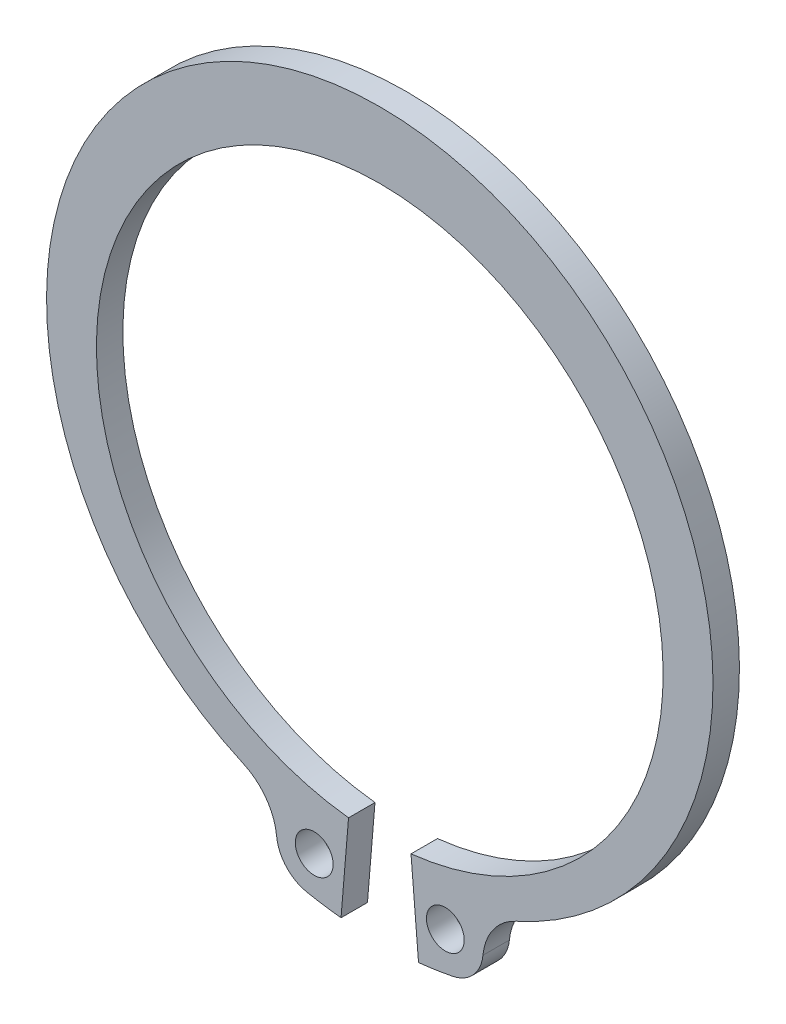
from build123d import *

# Parameters (mm, degrees)
ESQUISSE1_R          = 1.25
BASE_EXTRUSION_DEPTH = 1.75


with BuildPart() as part:
    # Esquisse1 → Base-Extrusion (new body)
    with BuildSketch(Plane.XY):
        with BuildLine():
            Line((2.066651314, -18.635757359), (2.564349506, -24.615079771))
            ThreePointArc((2.564349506, -24.615079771), (3.699248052, -24.47025959), (4.826240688, -24.273142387))
            ThreePointArc((4.826240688, -24.273142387), (6.190063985, -23.501164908), (6.826389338, -22.069015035))
            ThreePointArc((6.826389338, -22.069015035), (7.515164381, -20.248979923), (9.023331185, -19.019194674))
            ThreePointArc((9.023331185, -19.019194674), (0, 23.15), (-9.023331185, -19.019194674))
            ThreePointArc((-9.023331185, -19.019194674), (-7.515164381, -20.248979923), (-6.826389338, -22.069015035))
            ThreePointArc((-6.826389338, -22.069015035), (-6.190063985, -23.501164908), (-4.826240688, -24.273142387))
            ThreePointArc((-4.826240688, -24.273142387), (-3.699248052, -24.47025959), (-2.564349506, -24.615079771))
            Line((-2.564349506, -24.615079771), (-2.066651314, -18.635757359))
            ThreePointArc((-2.066651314, -18.635757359), (0, 18.75), (2.066651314, -18.635757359))
        make_face()
        with Locations((4.338708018, -21.821140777)):
            Circle(ESQUISSE1_R, mode=Mode.SUBTRACT)
        with Locations(Location((-4.338708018, -21.821140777, 0), (0, 0, 180))):
            Circle(ESQUISSE1_R, mode=Mode.SUBTRACT)
    extrude(amount=BASE_EXTRUSION_DEPTH)


solid = part.part
